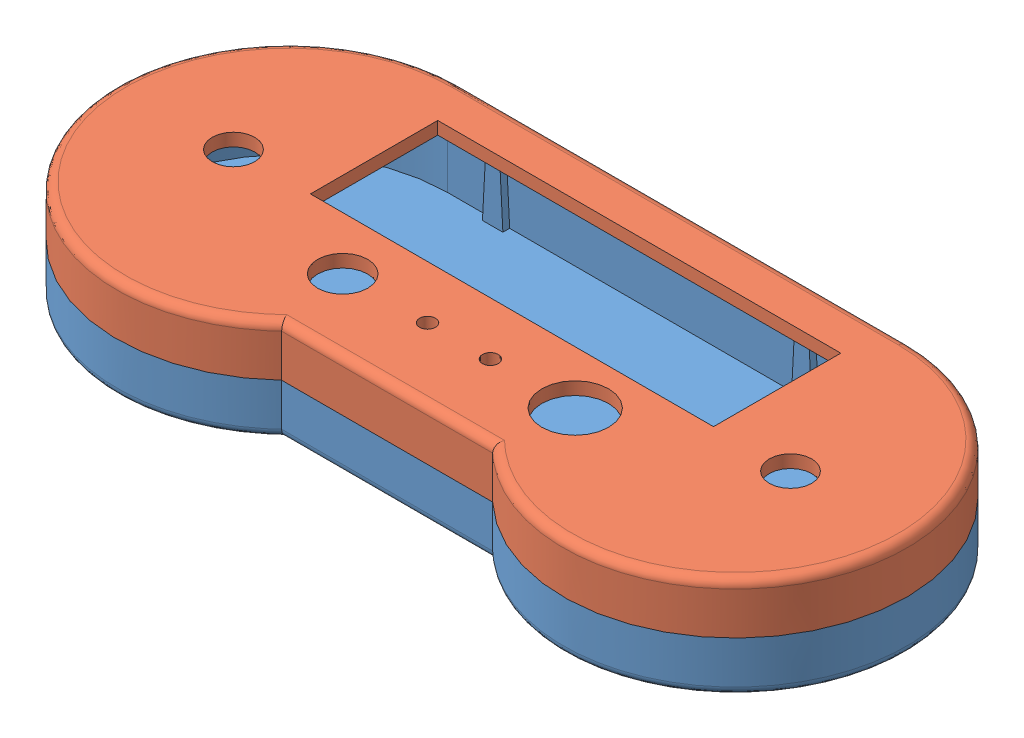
SolidWorks assembly bopitEnclosure.SLDASM, configuration Default (file format 12000). Lengths in mm.
Overall size (236.41 30.48 102.75).
2 component instances, 2 part files, 2 mates.
Components (placement in the parent):
- newbottom-1: newbottom.SLDPRT [Default] at origin size (236.41 26.67 102.75)
- top-3: top.SLDPRT [Default] at (0 15.24 0) size (236.41 15.24 102.75)
Mates (geometry in assembly coordinates):
- Coincident1: coincident aligned: line of newbottom-1 through (-31.5686 15.24 37.3634) axis (1 0 0); line of top-3 through (-31.5686 15.24 37.3634) axis (1 0 0)
- Coincident2: coincident aligned: circle of newbottom-1; circle of top-3
